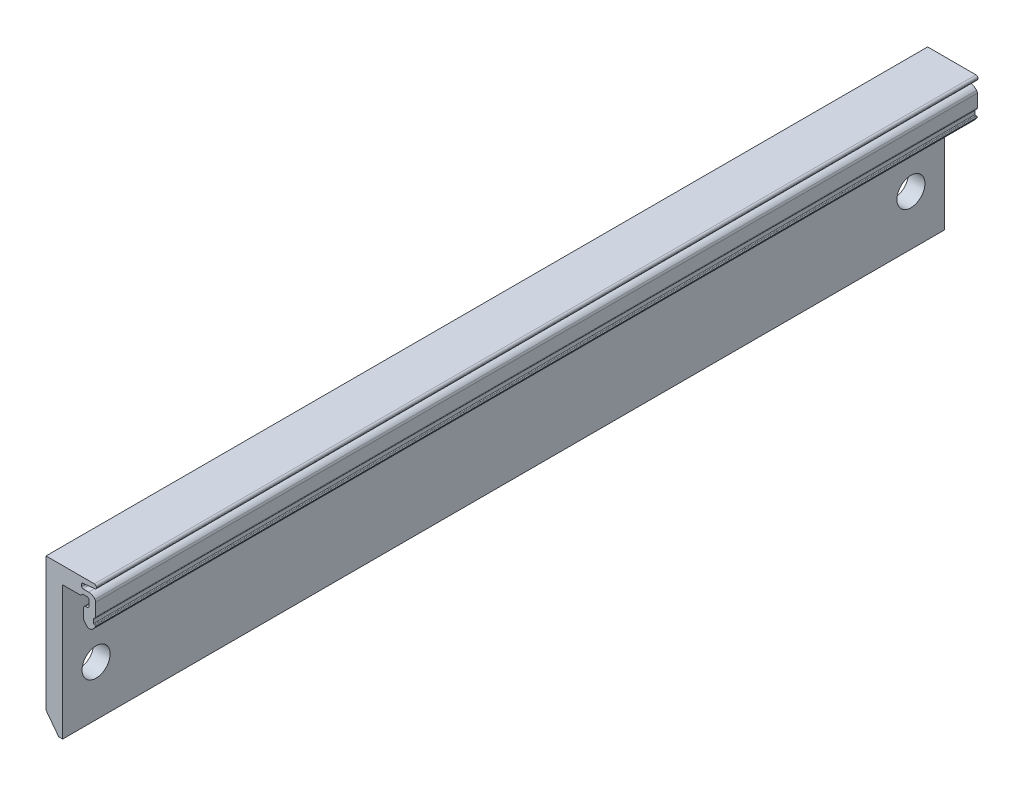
from build123d import *

# Parameters (mm, degrees)
EXTRUDE_1_DEPTH     = 66
SKETCH_3_R          = 2.1
CUT_EXTRUDE_1_DEPTH = 3314.269772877


with BuildPart() as part:
    # Sketch 1 → Extrude 1 (new, symmetric)
    with BuildSketch(Plane.XY):
        with BuildLine():
            Line((2350.384035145, -3290.103769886), (2355.384035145, -3290.103769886))
            Line((2355.384035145, -3290.103769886), (2357.624035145, -3290.103769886))
            ThreePointArc((2357.624035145, -3290.103769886), (2357.836167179, -3290.191637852), (2357.924035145, -3290.403769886))
            Line((2357.924035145, -3290.403769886), (2357.924035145, -3290.492459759))
            ThreePointArc((2357.924035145, -3290.492459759), (2357.87266411, -3290.626285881), (2357.744940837, -3290.691364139))
            Line((2357.744940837, -3290.691364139), (2355.903129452, -3290.884946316))
            ThreePointArc((2355.903129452, -3290.884946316), (2355.775406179, -3290.950024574), (2355.724035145, -3291.083850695))
            Line((2355.724035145, -3291.083850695), (2355.724035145, -3291.403769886))
            ThreePointArc((2355.724035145, -3291.403769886), (2355.782613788, -3291.545191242), (2355.924035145, -3291.603769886))
            Line((2355.924035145, -3291.603769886), (2356.769984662, -3291.603769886))
            ThreePointArc((2356.769984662, -3291.603769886), (2357.299096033, -3291.726717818), (2357.719785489, -3292.070367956))
            ThreePointArc((2357.719785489, -3292.070367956), (2357.797255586, -3292.214513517), (2357.824035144, -3292.375952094))
            Line((2357.824035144, -3292.375952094), (2357.824035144, -3294.273769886))
            ThreePointArc((2357.824035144, -3294.273769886), (2357.779946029, -3294.430325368), (2357.660637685, -3294.540864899))
            ThreePointArc((2357.660637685, -3294.540864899), (2357.54132934, -3294.65140443), (2357.497240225, -3294.807959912))
            Line((2357.497240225, -3294.807959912), (2357.497240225, -3295.307959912))
            ThreePointArc((2357.497240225, -3295.307959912), (2357.526529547, -3295.37867059), (2357.597240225, -3295.407959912))
            Line((2357.597240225, -3295.407959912), (2357.724035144, -3295.407959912))
            ThreePointArc((2357.724035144, -3295.407959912), (2357.794745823, -3295.437249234), (2357.824035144, -3295.507959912))
            Line((2357.824035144, -3295.507959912), (2357.824035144, -3295.527361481))
            ThreePointArc((2357.824035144, -3295.527361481), (2357.818000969, -3295.561572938), (2357.800626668, -3295.591655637))
            Line((2357.800626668, -3295.591655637), (2357.383057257, -3296.089092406))
            ThreePointArc((2357.383057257, -3296.089092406), (2356.924035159, -3296.303081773), (2356.465013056, -3296.089092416))
            Line((2356.465013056, -3296.089092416), (2356.094260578, -3295.647427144))
            ThreePointArc((2356.094260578, -3295.647427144), (2356.042137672, -3295.557179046), (2356.024035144, -3295.454544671))
            Line((2356.024035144, -3295.454544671), (2356.024035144, -3294.003769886))
            ThreePointArc((2356.024035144, -3294.003769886), (2356.11190311, -3293.791637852), (2356.324035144, -3293.703769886))
            Line((2356.324035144, -3293.703769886), (2356.524035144, -3293.703769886))
            ThreePointArc((2356.524035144, -3293.703769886), (2356.736167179, -3293.61590192), (2356.824035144, -3293.403769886))
            Line((2356.824035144, -3293.403769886), (2356.824035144, -3292.603769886))
            ThreePointArc((2356.824035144, -3292.603769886), (2356.736167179, -3292.391637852), (2356.524035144, -3292.303769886))
            Line((2356.524035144, -3292.303769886), (2355.987964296, -3292.303769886))
            ThreePointArc((2355.987964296, -3292.303769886), (2355.837964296, -3292.343962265), (2355.728156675, -3292.453769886))
            ThreePointArc((2355.728156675, -3292.453769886), (2355.618349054, -3292.563577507), (2355.468349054, -3292.603769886))
            Line((2355.468349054, -3292.603769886), (2355.384035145, -3292.603769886))
            Line((2355.384035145, -3292.603769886), (2352.884035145, -3292.603769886))
            Line((2352.884035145, -3292.603769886), (2352.884035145, -3312.603769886))
            Line((2352.884035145, -3312.603769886), (2352.284035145, -3312.603769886))
            Line((2352.284035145, -3312.603769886), (2350.384035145, -3310.103769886))
            Line((2350.384035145, -3310.103769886), (2350.384035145, -3292.603769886))
            Line((2350.384035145, -3292.603769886), (2350.384035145, -3290.103769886))
        make_face()
    extrude(amount=EXTRUDE_1_DEPTH, both=True)

    # Sketch 3 → Cut-Extrude 1 (cut, through all)
    with BuildSketch(Plane.ZY.offset(-2350.384035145)):
        with Locations(Location((-61, -3305.103769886, 0), (0, 0, 270))):
            Circle(SKETCH_3_R)
        with Locations(Location((61, -3305.103769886, 0), (0, 0, 270))):
            Circle(SKETCH_3_R)
    extrude(amount=-CUT_EXTRUDE_1_DEPTH, mode=Mode.SUBTRACT)


solid = part.part
